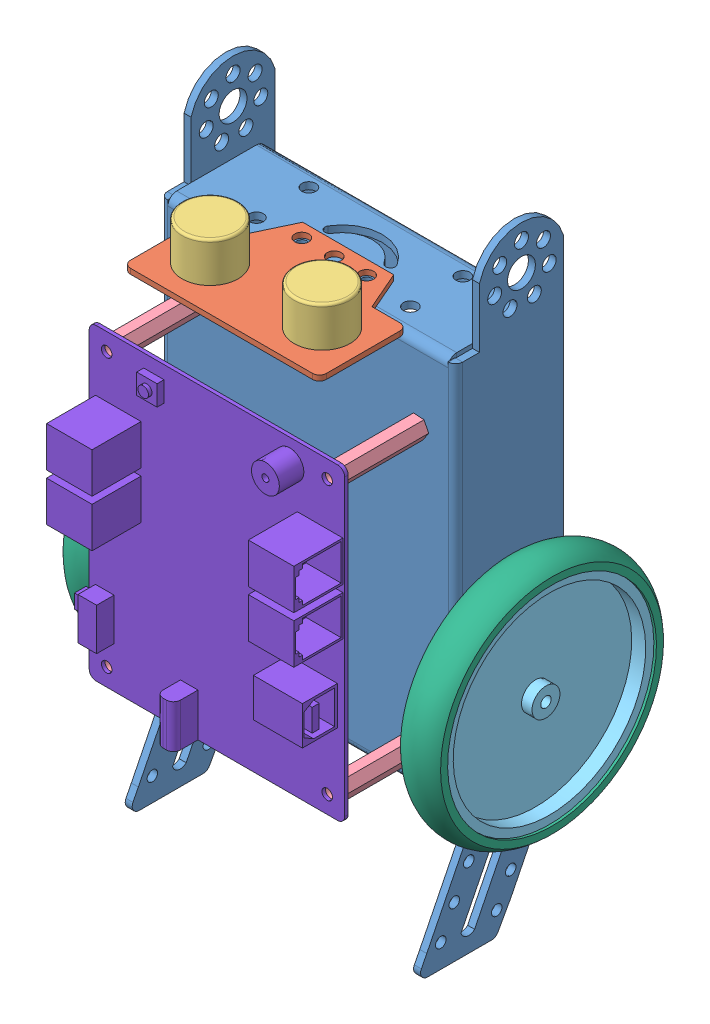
SolidWorks assembly ASSEMBLAGE Robot Mbot.SLDASM, configuration Défaut (file format 8000). Lengths in mm.
Overall size (208.9 270.28 103.72).
18 component instances, 8 part files, 24 mates.
Components (placement in the parent):
- Base robot-1: Base robot.SLDPRT [Défaut] at (-55.2045 -18.7435 10.3897) size (84.4 173.31 40.82)
- Assemblage carte ultrasons-1: Assemblage carte ultrasons.SLDASM [Défaut] at (-103.8383 86.2887 -1.671) x (-1 0 0) z (0 1 0) size (56 36 12.9)
  - carte ultrason-1: carte ultrason.SLDPRT [Défaut] at (-80.0358 11.7973 -0.75) size (56 36 1.5)
  - Cylindre ultrasons-1: Cylindre ultrasons.SLDPRT [Predeterminado] at (-68.0358 24.0482 12.15) x (-0.161416 -0.986886 0) z (0 0 -1) size (16 16 12.4)
  - Cylindre ultrasons-2: Cylindre ultrasons.SLDPRT [Predeterminado] at (-36.0358 24.0482 12.15) x (-0.574539 -0.818477 0) z (0 0 -1) size (16 16 12.4)
- Entretoise support carte élec-1: Entretoise support carte élec.SLDPRT [Défaut] at (-20.3305 -13.7435 10.3897) x (0.999351 0.036027 0) z (0 0 1) size (6 5.27 25)
- Entretoise support carte élec-2: Entretoise support carte élec.SLDPRT [Défaut] at (-83.3285 -13.7435 10.3897) x (0.999351 0.036027 0) z (0 0 1) size (6 5.27 25)
- Entretoise support carte élec-3: Entretoise support carte élec.SLDPRT [Défaut] at (-83.3285 64.2565 10.3897) x (0.999351 0.036027 0) z (0 0 1) size (6 5.27 25)
- Entretoise support carte élec-4: Entretoise support carte élec.SLDPRT [Défaut] at (-20.3305 64.2565 10.3897) x (0.996129 -0.087906 0) z (0 0 1) size (6 5.27 25)
- Roue complète-1: Roue complète.SLDASM [Défaut] at (-12.2665 -44.8419 -38.1712) x (0 -0.798009 -0.602646) z (0 0.602646 -0.798009) size (68.42 11.74 68.42)
  - roue-1: roue.SLDPRT [Default] at (-54.361 -13.6369 0) size (62.55 11 62.54)
  - pneu-1: pneu.SLDPRT [Défaut] at (-86.1957 -14.3752 0) x (0 1 0) z (0 0 1) size (11.48 68.42 68.42)
- Roue complète-2: Roue complète.SLDASM [Défaut] at (-91.3926 -55.8223 -5.4108) x (0 -1 0) z (0 0 1) size (68.42 11.74 68.42)
  - roue-1: roue.SLDPRT [Default] at (-54.361 -13.6369 0) size (62.55 11 62.54)
  - pneu-1: pneu.SLDPRT [Défaut] at (-86.1957 -14.3752 0) x (0 1 0) z (0 0 1) size (11.48 68.42 68.42)
- Moto Reducteur-1: Moto Reducteur.SLDPRT [Predeterminado] at (-21.0295 35.3387 -5.4108) x (0 -1 0) z (1 0 0) size (69.7 22.5 23.8)
- Moto Reducteur-2: Moto Reducteur.SLDPRT [Predeterminado] at (-82.6295 35.3387 -5.4108) x (0 -1 0) z (-1 0 0) size (69.7 22.5 23.8)
- carte mère2-1: carte mère2.SLDPRT [Défaut] at (-88.3305 69.2565 36.3897) x (1 0 0) z (0 0 -1) size (191.67 226.5 15)
Mates (geometry in assembly coordinates):
- Coïncidente1: coincident anti-aligned: plane of Base robot-1 through (-55.2045 85.5387 10.3897) normal (0 1 0); plane of Assemblage carte ultrasons-1/carte ultrason-1 through (-25.8026 85.5387 12.1263) normal (0 -1 0)
- Coaxiale1: concentric aligned: circle of Base robot-1; circle of Assemblage carte ultrasons-1/carte ultrason-1
- Coaxiale2: concentric aligned: circle of Base robot-1; circle of Assemblage carte ultrasons-1/carte ultrason-1
- Coaxiale5: concentric anti-aligned: cylinder of Base robot-1 through (-11.6295 -1.4613 -5.4108) axis (1 0 0) radius 6; cylinder of Moto Reducteur-1 through (-9.6295 -1.4613 -5.4108) axis (-1 0 0) radius 6
- Parallèle2: parallel aligned: plane of Base robot-1 through (-11.6295 84.5387 -20.4108) normal (0 0 -1); plane of Moto Reducteur-1 through (-11.6295 -10.3613 -16.6608) normal (0 0 -1)
- Coïncidente16: coincident anti-aligned: plane of Base robot-1 through (-11.6295 -60.6059 78.7677) normal (-1 0 0); plane of Moto Reducteur-1 through (-11.6295 -10.3613 3.5392) normal (1 0 0)
- Coaxiale6: concentric aligned: circle of Roue complète-1/roue-1; circle of Moto Reducteur-1
- Coïncidente17: coincident anti-aligned: plane of Roue complète-1/roue-1 through (-9.6295 -1.4613 -5.4108) normal (-1 0 0); plane of Moto Reducteur-1 through (-9.6295 -1.4613 -5.4108) normal (1 0 0)
- Coaxiale7: concentric anti-aligned: cylinder of Base robot-1 through (-92.0295 -1.4613 -5.4108) axis (-1 0 0) radius 6; cylinder of Moto Reducteur-2 through (-94.0295 -1.4613 -5.4108) axis (1 0 0) radius 6
- Coïncidente18: coincident anti-aligned: plane of Base robot-1 through (-92.0295 -60.6059 18.4108) normal (1 0 0); plane of Moto Reducteur-2 through (-92.0295 -10.3613 -14.3608) normal (-1 0 0)
- Parallèle3: parallel aligned: plane of Base robot-1 through (-92.0295 -24.7435 -20.4108) normal (0 0 -1); plane of Moto Reducteur-2 through (-92.0295 -10.3613 -16.6608) normal (0 0 -1)
- Coaxiale8: concentric anti-aligned: circle of Roue complète-2/roue-1; circle of Moto Reducteur-2
- Coïncidente19: coincident anti-aligned: plane of Roue complète-2/roue-1 through (-94.0295 -1.4613 -5.4108) normal (1 0 0); plane of Moto Reducteur-2 through (-94.0295 -1.4613 -5.4108) normal (-1 0 0)
- Coaxiale9: concentric aligned: circle of Base robot-1; circle of Entretoise support carte élec-4
- Coïncidente20: coincident anti-aligned: plane of Base robot-1 through (-82.008 -60.6059 10.3897) normal (0 0 1); plane of Entretoise support carte élec-4 through (-20.3305 64.2565 10.3897) normal (0 0 -1)
- Coaxiale10: concentric aligned: circle of Base robot-1; circle of Entretoise support carte élec-1
- Coïncidente21: coincident anti-aligned: plane of Base robot-1 through (-82.008 -60.6059 10.3897) normal (0 0 1); plane of Entretoise support carte élec-1 through (-20.3305 -13.7435 10.3897) normal (0 0 -1)
- Coaxiale11: concentric aligned: circle of Base robot-1; circle of Entretoise support carte élec-2
- Coïncidente22: coincident anti-aligned: plane of Base robot-1 through (-82.008 -60.6059 10.3897) normal (0 0 1); plane of Entretoise support carte élec-2 through (-83.3285 -13.7435 10.3897) normal (0 0 -1)
- Coaxiale12: concentric aligned: circle of Base robot-1; circle of Entretoise support carte élec-3
- Coïncidente23: coincident anti-aligned: plane of Base robot-1 through (-82.008 -60.6059 10.3897) normal (0 0 1); plane of Entretoise support carte élec-3 through (-83.3285 64.2565 10.3897) normal (0 0 -1)
- Coaxiale13: concentric anti-aligned: circle of Entretoise support carte élec-4; circle of carte mère2-1
- Coïncidente24: coincident anti-aligned: plane of Entretoise support carte élec-4 through (-20.3305 64.2565 35.3897) normal (0 0 1); plane of carte mère2-1 through (-88.3305 69.2565 35.3897) normal (0 0 -1)
- Parallèle4: parallel aligned: plane of Base robot-1 through (-9.6295 -60.6059 78.7677) normal (1 0 0); plane of carte mère2-1 through (-15.3305 69.2565 35.3897) normal (1 0 0)
